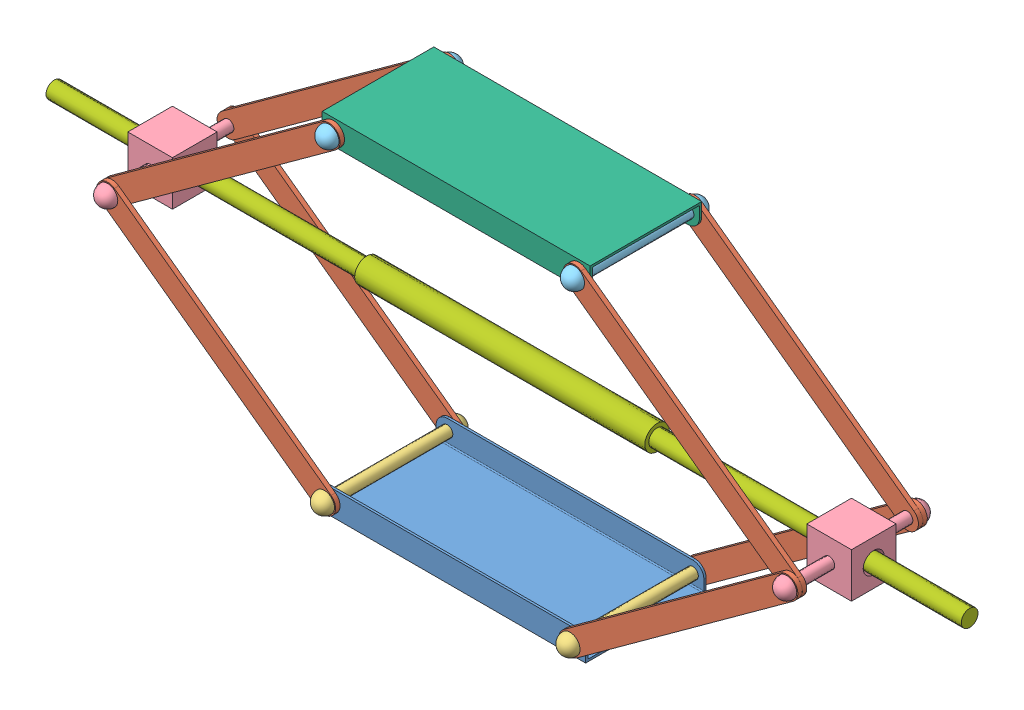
SolidWorks assembly FullAssembly.SLDASM, configuration Default (file format 9000). Lengths in mm.
Overall size (520.7 196.9 85.09).
17 component instances, 7 part files, 35 mates.
Components (placement in the parent):
- LowerBase-1: LowerBase.SLDPRT [Default] at origin size (152.4 13.97 68.58)
- Link-1: Link.SLDPRT [Default] at (146.05 7.62 -71.12) x (0.809017 0.587785 0) z (0 0 1) size (165.1 12.7 2.54)
- Link-2: Link.SLDPRT [Default] at (-116.9442 97.1985 0) x (0.809017 -0.587785 0) z (0 0 1) size (165.1 12.7 2.54)
- Link-3: Link.SLDPRT [Default] at (146.05 7.62 0) x (0.809017 0.587785 0) z (0 0 1) size (165.1 12.7 2.54)
- Link-4: Link.SLDPRT [Default] at (-116.9442 97.1985 -71.12) x (0.809017 -0.587785 0) z (0 0 1) size (165.1 12.7 2.54)
- LongPin-2: LongPin.SLDPRT [Default] at (6.35 7.62 2.54) x (0 0 -1) z (0.942349 0.334631 0) size (85.09 11.43 11.43)
- LongPin-3: LongPin.SLDPRT [Default] at (146.05 7.62 -71.12) x (0 0 1) z (-0.999213 0.039654 0) size (85.09 11.43 11.43)
- Pivot-1: Pivot.SLDPRT [Default] at (-129.6442 84.4985 -21.59) x (0 0 -1) z (1 0 0) size (85.09 25.4 25.4)
- Pivot-2: Pivot.SLDPRT [Default] at (256.6442 84.4985 -21.59) x (0 0 -1) z (1 0 0) size (85.09 25.4 25.4)
- Link-5: Link.SLDPRT [Default] at (-116.9442 97.1985 -68.58) x (0.809017 0.587785 0) z (0 0 1) size (165.1 12.7 2.54)
- Link-6: Link.SLDPRT [Default] at (146.05 186.7769 -68.58) x (0.809017 -0.587785 0) z (0 0 1) size (165.1 12.7 2.54)
- Link-7: Link.SLDPRT [Default] at (-116.9442 97.1985 -2.54) x (0.809017 0.587785 0) z (0 0 1) size (165.1 12.7 2.54)
- Link-8: Link.SLDPRT [Default] at (146.05 186.7769 -2.54) x (0.809017 -0.587785 0) z (0 0 1) size (165.1 12.7 2.54)
- ShortPin-1: ShortPin.SLDPRT [Default] at (6.35 186.7769 -68.58) x (0 0 1) z (0.360248 -0.932857 0) size (80.01 11.43 11.43)
- ShortPin-2: ShortPin.SLDPRT [Default] at (146.05 186.7769 0) x (0 0 -1) z (-0.999142 0.041427 0) size (80.01 11.43 11.43)
- UpperBase-1: UpperBase.SLDPRT [Default] at (152.4 194.3969 -2.54) x (-1 0 0) z (0 0 1) size (152.4 13.97 63.5)
- Rod-1: Rod.SLDPRT [Default] at (76.2228 97.1985 -34.29) x (1 0 0) z (0 0.497938 0.867213) size (520.7 13.97 13.97)
Mates (geometry in assembly coordinates):
- Coincident2: coincident aligned: circle of LowerBase-1; circle of Link-2
- Coincident3: coincident aligned: circle of LowerBase-1; circle of Link-4
- Coincident4: coincident aligned: circle of LowerBase-1; circle of Link-3
- Coincident5: coincident aligned: circle of LowerBase-1; circle of Link-1
- Parallel2: parallel anti-aligned: plane of LowerBase-1 through (0 1.27 -68.58) normal (0 0 -1); plane of LongPin-2 through (4.4376 13.0055 -71.12) normal (0 0 1)
- Coincident10: coincident aligned: circle of Link-4; circle of LongPin-2
- Parallel3: parallel anti-aligned: plane of Link-3 through (146.05 7.62 2.54) normal (0 0 1); plane of LongPin-3 through (146.2766 13.3305 2.54) normal (0 0 -1)
- Coincident12: coincident anti-aligned: circle of Link-3; circle of LongPin-3
- Parallel4: parallel anti-aligned: plane of Link-3 through (146.05 7.62 2.54) normal (0 0 1); plane of Pivot-2 through (269.3442 100.3735 2.54) normal (0 0 -1)
- Parallel5: parallel anti-aligned: plane of Link-2 through (-116.9442 97.1985 2.54) normal (0 0 1); plane of Pivot-1 through (-116.9442 100.3735 2.54) normal (0 0 -1)
- Coincident15: coincident anti-aligned: circle of Link-2; circle of Pivot-1
- Coincident16: coincident anti-aligned: circle of Link-3; circle of Pivot-2
- Coincident17: coincident anti-aligned: circle of Link-4; circle of Pivot-1
- Coincident18: coincident anti-aligned: circle of Link-1; circle of Pivot-2
- Concentric3: concentric aligned: cylinder of Pivot-1 through (-104.2442 97.1985 -34.29) axis (-1 0 0) radius 4.7625; cylinder of Pivot-2 through (282.0442 97.1985 -34.29) axis (-1 0 0) radius 4.7625
- Angle1: planar angle = 0.628319 rad aligned: line of Link-2 through (10.0824 12.7573 0) axis (-0.809017 0.587785 0); line of Pivot-1 through (-104.2442 84.4985 -21.59) axis (-1 0 0)
- Angle2: planar angle = 0.628319 rad aligned: line of Pivot-2 through (282.0442 84.4985 -21.59) axis (-1 0 0); line of Link-3 through (265.6118 102.3357 0) axis (-0.809017 -0.587785 0)
- Coincident21: coincident aligned: circle of Link-3; circle of Link-8
- Coincident23: coincident aligned: circle of Link-2; circle of Link-7
- Coincident24: coincident aligned: circle of Link-1; circle of Link-6
- Coincident25: coincident aligned: circle of Link-4; circle of Link-5
- Coincident26: coincident anti-aligned: circle of Link-5; circle of ShortPin-1
- Coincident27: coincident anti-aligned: circle of Link-7; circle of ShortPin-1
- Coincident28: coincident aligned: circle of Link-8; circle of ShortPin-2
- Coincident29: coincident aligned: circle of Link-6; circle of ShortPin-2
- Parallel8: parallel anti-aligned: plane of LowerBase-1 through (0 1.27 0) normal (0 1 0); plane of UpperBase-1 through (152.4 193.1269 -2.54) normal (0 -1 0)
- Coincident31: coincident aligned: circle of Link-7; circle of UpperBase-1
- Coincident32: coincident aligned: circle of Link-6; circle of UpperBase-1
- Concentric4: concentric aligned: cylinder of Pivot-2 through (282.0442 97.1985 -34.29) axis (-1 0 0) radius 4.7625; cylinder of Rod-1 through (-184.1272 97.1985 -34.29) axis (-1 0 0) radius 4.7625
- Distance1: distance = 54.483 mm aligned: plane of Pivot-1 through (-129.6442 84.4985 -21.59) normal (-1 0 0); plane of Rod-1 through (-184.1272 97.1985 -34.29) normal (-1 0 0)
- Concentric11: concentric aligned: cylinder of Pivot-1 through (-104.2442 97.1985 -34.29) axis (-1 0 0) radius 4.7625; cylinder of Rod-1 through (-184.1272 97.1985 -34.29) axis (-1 0 0) radius 4.7625
- Concentric12: concentric aligned: cylinder of LowerBase-1 through (6.35 7.62 -68.58) axis (0 0 1) radius 3.175; cylinder of LongPin-2 through (6.35 7.62 -0.5811) axis (0 0 1) radius 3.175
- Concentric13: concentric anti-aligned: cylinder of LowerBase-1 through (146.05 7.62 -68.58) axis (0 0 1) radius 3.175; cylinder of LongPin-3 through (146.05 7.62 -67.9989) axis (0 0 -1) radius 3.175
- Concentric14: concentric aligned: cylinder of ShortPin-2 through (146.05 186.7769 -3.1211) axis (0 0 1) radius 3.175; cylinder of UpperBase-1 through (146.05 186.7769 -66.04) axis (0 0 1) radius 3.175
- Concentric15: concentric anti-aligned: cylinder of ShortPin-1 through (6.35 186.7769 -65.4589) axis (0 0 -1) radius 3.175; cylinder of UpperBase-1 through (6.35 186.7769 -66.04) axis (0 0 1) radius 3.175
